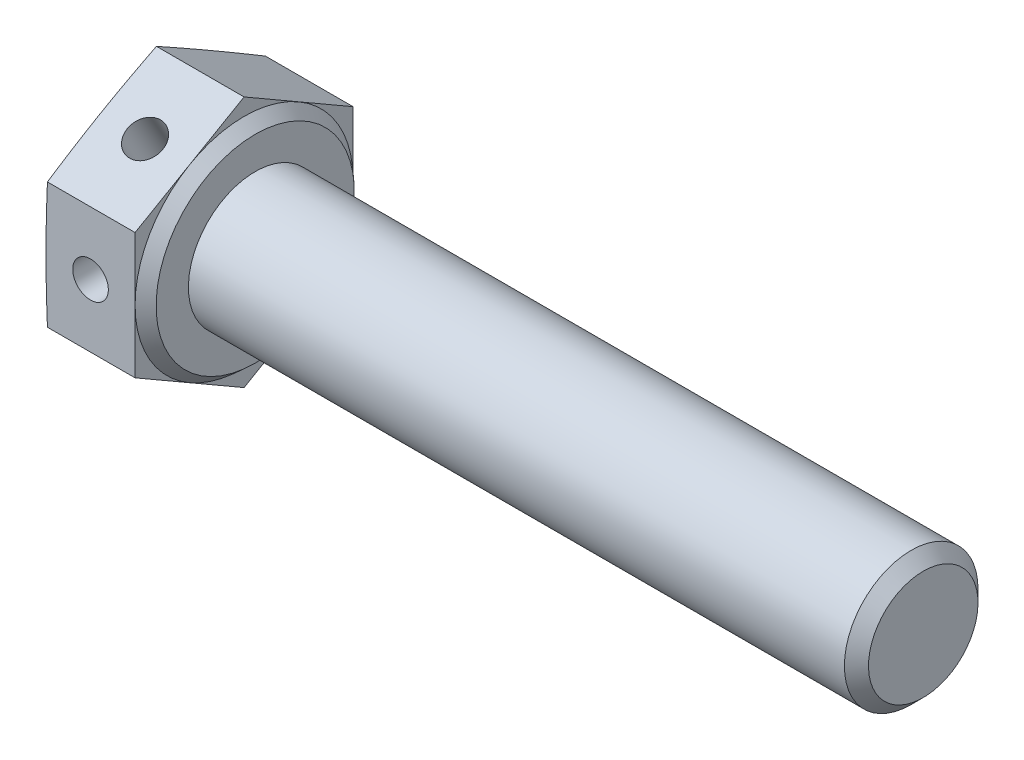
from build123d import *

# Parameters (mm, degrees)
BASEHEAD_DEPTH    = 4
SKETCH3_R         = 3
BASEBODY_DEPTH    = 30
CHAMFER1_SIZE     = 0.5415
SKETCH5_R         = 0.8
HOLE_DEPTH        = 36.30097815
CIRPATTERN1_COUNT = 2
CIRPATTERN1_ANGLE = 60


with BuildPart() as part:
    # Sketch-BaseHead → BaseHead (new body)
    with BuildSketch(Plane(origin=(0, 0, 0), x_dir=(0, 0, -1), z_dir=(1, 0, 0))):
        Polygon((0, -5.652259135), (4.895, -2.826129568), (4.895, 2.826129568), (0, 5.652259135), (-4.895, 2.826129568), (-4.895, -2.826129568), align=None)
    extrude(amount=BASEHEAD_DEPTH)

    # Sketch4 → HeadChamfer (revolve, cut)
    with BuildSketch(Plane(origin=(-0.264637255, -5.916896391, 0), x_dir=(0, 1, 0), z_dir=(0, 0, 1))):
        Polygon((11.569155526, -0.264637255), (10.811896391, -0.264637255), (11.569155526, -0.329490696), align=None)
    revolve(axis=Axis((-4.001564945, 0, 0), (1, 0, 0)), mode=Mode.SUBTRACT)

    # Sketch2 → Revolve1 (revolve)
    with BuildSketch(Plane(origin=(0, 0, 0), x_dir=(1, 0, 0), z_dir=(0, 1, 0)), mode=Mode.PRIVATE) as revolve1_sk:
        Polygon((4, 0), (4.5, 0), (4.5, 4.45), (4, 4.895), align=None)
    revolve(revolve1_sk.sketch.rotate(Axis((-4.001564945, 0, 0), (1, 0, 0)), 270), axis=Axis((-4.001564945, 0, 0), (1, 0, 0)))

    # Sketch3 → BaseBody (add)
    with BuildSketch(Plane(origin=(4.5, 0, 0), x_dir=(0, 0, -1), z_dir=(1, 0, 0))):
        with Locations(Location((0, 0, 0), (0, 0, 270))):
            Circle(SKETCH3_R)
    extrude(amount=BASEBODY_DEPTH)

    # Chamfer1
    chamfer1_edges = [part.edges().sort_by_distance(p)[0] for p in [
        (34.5, 3, 0),
    ]]
    chamfer(chamfer1_edges, length=CHAMFER1_SIZE)

    # Sketch5 → Hole (cut, symmetric)
    with BuildSketch(Plane.XY):
        with Locations((2, 0)):
            Circle(SKETCH5_R)
    hole = extrude(amount=HOLE_DEPTH, both=True, mode=Mode.SUBTRACT)

    # CirPattern1: Hole ×2 about axis
    cirpattern1_axis = Axis((34.5, 0, 0), (-1, 0, 0))
    for i in range(1, CIRPATTERN1_COUNT):
        add(hole.rotate(cirpattern1_axis, i * CIRPATTERN1_ANGLE / (CIRPATTERN1_COUNT - 1)), mode=Mode.SUBTRACT)


solid = part.part
